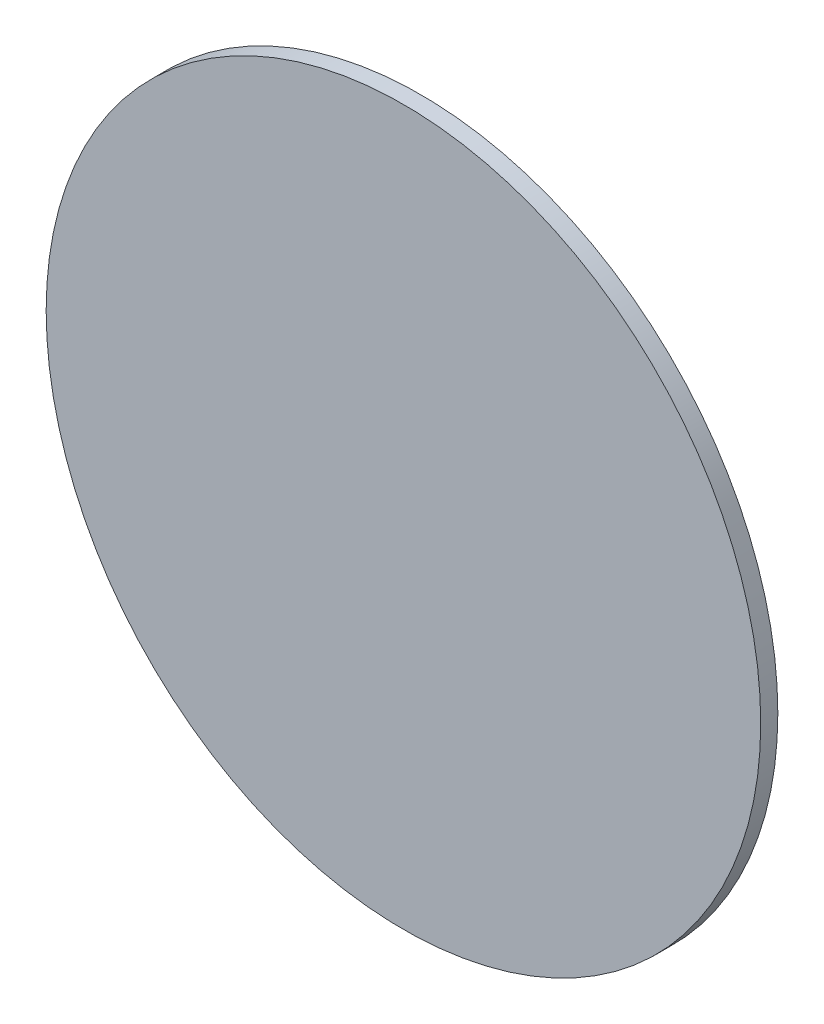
from build123d import *

# Parameters (mm, degrees)
SKETCH1_R           = 10.45
BOSS_EXTRUDE1_DEPTH = 0.5


with BuildPart() as part:
    # Sketch1 → Boss-Extrude1 (new body)
    with BuildSketch(Plane.XY):
        Circle(SKETCH1_R)
    extrude(amount=BOSS_EXTRUDE1_DEPTH)


solid = part.part
